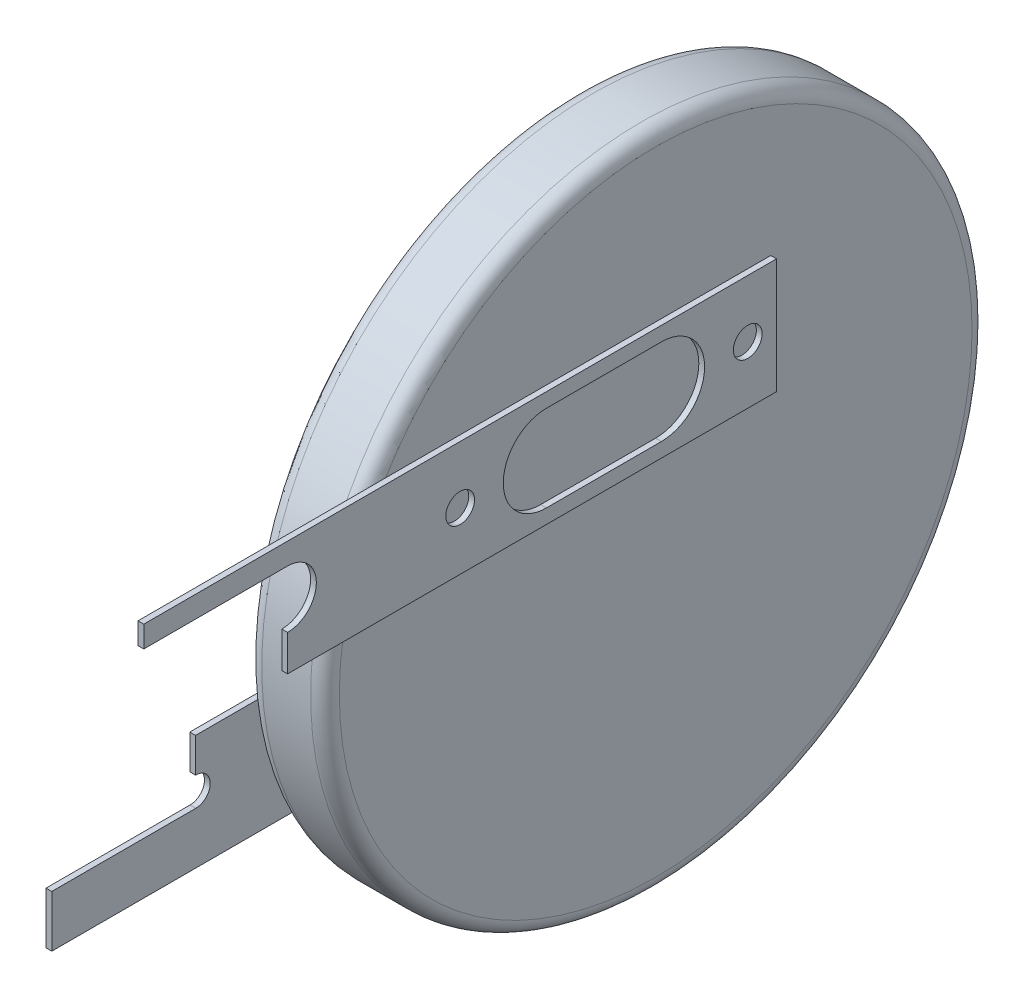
ISO-10303-21;
HEADER;
FILE_DESCRIPTION(('STEP AP214'),'2;1');
FILE_NAME('part.step','',(''),(''),'','','');
FILE_SCHEMA(('AUTOMOTIVE_DESIGN { 1 0 10303 214 1 1 1 1 }'));
ENDSEC;
DATA;
#1=APPLICATION_CONTEXT('core data for automotive mechanical design processes');
#2=APPLICATION_PROTOCOL_DEFINITION('international standard','automotive_design',2000,#1);
#3=PRODUCT_CONTEXT('',#1,'mechanical');
#4=PRODUCT('Part','Part','',(#3));
#5=PRODUCT_RELATED_PRODUCT_CATEGORY('part','',(#4));
#6=PRODUCT_DEFINITION_FORMATION('','',#4);
#7=PRODUCT_DEFINITION_CONTEXT('part definition',#1,'design');
#8=PRODUCT_DEFINITION('design','',#6,#7);
#9=PRODUCT_DEFINITION_SHAPE('','',#8);
#10=(LENGTH_UNIT() NAMED_UNIT(*) SI_UNIT(.MILLI.,.METRE.));
#11=(NAMED_UNIT(*) PLANE_ANGLE_UNIT() SI_UNIT($,.RADIAN.));
#12=(NAMED_UNIT(*) SI_UNIT($,.STERADIAN.) SOLID_ANGLE_UNIT());
#13=UNCERTAINTY_MEASURE_WITH_UNIT(LENGTH_MEASURE(1.E-05),#10,'distance_accuracy_value','');
#14=(GEOMETRIC_REPRESENTATION_CONTEXT(3) GLOBAL_UNCERTAINTY_ASSIGNED_CONTEXT((#13)) GLOBAL_UNIT_ASSIGNED_CONTEXT((#10,
#11,#12)) REPRESENTATION_CONTEXT('',''));
#15=CARTESIAN_POINT('',(0.,0.,0.));
#16=DIRECTION('',(0.,0.,1.));
#17=DIRECTION('',(1.,0.,0.));
#18=AXIS2_PLACEMENT_3D('',#15,#16,#17);
#19=CARTESIAN_POINT('',(0.,0.,0.));
#20=DIRECTION('',(1.,0.,0.));
#21=DIRECTION('',(0.,0.,-1.));
#22=AXIS2_PLACEMENT_3D('',#19,#20,#21);
#23=PLANE('',#22);
#24=DIRECTION('',(0.,1.,0.));
#25=VECTOR('',#24,1.);
#26=CARTESIAN_POINT('',(0.,5.725,-4.));
#27=LINE('',#26,#25);
#28=CARTESIAN_POINT('',(0.,1.725,-4.));
#29=VERTEX_POINT('',#28);
#30=CARTESIAN_POINT('',(0.,5.725,-4.));
#31=VERTEX_POINT('',#30);
#32=EDGE_CURVE('E70',#29,#31,#27,.T.);
#33=ORIENTED_EDGE('',*,*,#32,.F.);
#34=DIRECTION('',(0.,0.,-1.));
#35=VECTOR('',#34,1.);
#36=CARTESIAN_POINT('',(0.,1.725,13.));
#37=LINE('',#36,#35);
#38=CARTESIAN_POINT('',(0.,1.725,10.8639023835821));
#39=VERTEX_POINT('',#38);
#40=EDGE_CURVE('E294',#39,#29,#37,.T.);
#41=ORIENTED_EDGE('',*,*,#40,.F.);
#42=CARTESIAN_POINT('',(0.,0.,0.));
#43=DIRECTION('',(1.,0.,0.));
#44=DIRECTION('',(0.,0.,-1.));
#45=AXIS2_PLACEMENT_3D('',#42,#43,#44);
#46=CIRCLE('',#45,11.);
#47=CARTESIAN_POINT('',(0.,5.725,9.39278313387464));
#48=VERTEX_POINT('',#47);
#49=EDGE_CURVE('E434',#39,#48,#46,.T.);
#50=ORIENTED_EDGE('',*,*,#49,.T.);
#51=DIRECTION('',(0.,0.,1.));
#52=VECTOR('',#51,1.);
#53=CARTESIAN_POINT('',(0.,5.725,18.));
#54=LINE('',#53,#52);
#55=EDGE_CURVE('E75',#31,#48,#54,.T.);
#56=ORIENTED_EDGE('',*,*,#55,.F.);
#57=EDGE_LOOP('',(#33,#41,#50,#56));
#58=FACE_BOUND('',#57,.T.);
#59=ADVANCED_FACE('F55',(#58),#23,.T.);
#60=CARTESIAN_POINT('',(-0.500000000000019,0.,0.));
#61=DIRECTION('',(1.,0.,0.));
#62=DIRECTION('',(0.,0.,-1.));
#63=AXIS2_PLACEMENT_3D('',#60,#61,#62);
#64=TOROIDAL_SURFACE('',#63,11.,0.5);
#65=CARTESIAN_POINT('',(-0.500000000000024,0.,0.));
#66=DIRECTION('',(1.,0.,0.));
#67=DIRECTION('',(0.,0.,-1.));
#68=AXIS2_PLACEMENT_3D('',#65,#66,#67);
#69=CIRCLE('',#68,11.5);
#70=CARTESIAN_POINT('',(-0.500000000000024,0.,-11.5));
#71=VERTEX_POINT('',#70);
#72=EDGE_CURVE('E431',#71,#71,#69,.T.);
#73=ORIENTED_EDGE('',*,*,#72,.T.);
#74=EDGE_LOOP('',(#73));
#75=FACE_BOUND('',#74,.T.);
#76=EDGE_CURVE('E435',#48,#39,#46,.T.);
#77=ORIENTED_EDGE('',*,*,#76,.F.);
#78=ORIENTED_EDGE('',*,*,#49,.F.);
#79=EDGE_LOOP('',(#77,#78));
#80=FACE_BOUND('',#79,.T.);
#81=ADVANCED_FACE('F462',(#75,#80),#64,.T.);
#82=CARTESIAN_POINT('',(0.,0.,0.));
#83=DIRECTION('',(1.,0.,0.));
#84=DIRECTION('',(0.,0.,-1.));
#85=AXIS2_PLACEMENT_3D('',#82,#83,#84);
#86=CYLINDRICAL_SURFACE('',#85,11.5);
#87=CARTESIAN_POINT('',(-2.20000000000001,0.,0.));
#88=DIRECTION('',(1.,0.,0.));
#89=DIRECTION('',(0.,0.,-1.));
#90=AXIS2_PLACEMENT_3D('',#87,#88,#89);
#91=CIRCLE('',#90,11.5);
#92=CARTESIAN_POINT('',(-2.20000000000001,0.,-11.5));
#93=VERTEX_POINT('',#92);
#94=EDGE_CURVE('E428',#93,#93,#91,.T.);
#95=ORIENTED_EDGE('',*,*,#94,.T.);
#96=EDGE_LOOP('',(#95));
#97=FACE_BOUND('',#96,.T.);
#98=ORIENTED_EDGE('',*,*,#72,.F.);
#99=EDGE_LOOP('',(#98));
#100=FACE_BOUND('',#99,.T.);
#101=ADVANCED_FACE('F467',(#97,#100),#86,.T.);
#102=CARTESIAN_POINT('',(-2.20000000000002,0.,0.));
#103=DIRECTION('',(1.,0.,0.));
#104=DIRECTION('',(0.,0.,-1.));
#105=AXIS2_PLACEMENT_3D('',#102,#103,#104);
#106=TOROIDAL_SURFACE('',#105,11.,0.499999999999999);
#107=CARTESIAN_POINT('',(-2.70000000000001,0.,0.));
#108=DIRECTION('',(1.,0.,0.));
#109=DIRECTION('',(0.,0.,-1.));
#110=AXIS2_PLACEMENT_3D('',#107,#108,#109);
#111=CIRCLE('',#110,11.);
#112=CARTESIAN_POINT('',(-2.70000000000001,0.,-11.));
#113=VERTEX_POINT('',#112);
#114=EDGE_CURVE('E425',#113,#113,#111,.T.);
#115=ORIENTED_EDGE('',*,*,#114,.T.);
#116=EDGE_LOOP('',(#115));
#117=FACE_BOUND('',#116,.T.);
#118=ORIENTED_EDGE('',*,*,#94,.F.);
#119=EDGE_LOOP('',(#118));
#120=FACE_BOUND('',#119,.T.);
#121=ADVANCED_FACE('F473',(#117,#120),#106,.T.);
#122=CARTESIAN_POINT('',(-2.70000000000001,11.,0.));
#123=DIRECTION('',(-1.,0.,0.));
#124=DIRECTION('',(0.,0.,1.));
#125=AXIS2_PLACEMENT_3D('',#122,#123,#124);
#126=PLANE('',#125);
#127=CARTESIAN_POINT('',(-2.7,0.,0.));
#128=DIRECTION('',(1.,0.,0.));
#129=DIRECTION('',(0.,0.,-1.));
#130=AXIS2_PLACEMENT_3D('',#127,#128,#129);
#131=CIRCLE('',#130,9.5);
#132=CARTESIAN_POINT('',(-2.7,0.,-9.5));
#133=VERTEX_POINT('',#132);
#134=EDGE_CURVE('E422',#133,#133,#131,.T.);
#135=ORIENTED_EDGE('',*,*,#134,.T.);
#136=EDGE_LOOP('',(#135));
#137=FACE_BOUND('',#136,.T.);
#138=ORIENTED_EDGE('',*,*,#114,.F.);
#139=EDGE_LOOP('',(#138));
#140=FACE_BOUND('',#139,.T.);
#141=ADVANCED_FACE('F480',(#137,#140),#126,.T.);
#142=CARTESIAN_POINT('',(0.,0.,0.));
#143=DIRECTION('',(1.,0.,0.));
#144=DIRECTION('',(0.,0.,-1.));
#145=AXIS2_PLACEMENT_3D('',#142,#143,#144);
#146=CYLINDRICAL_SURFACE('',#145,9.5);
#147=CARTESIAN_POINT('',(-2.75,0.,0.));
#148=DIRECTION('',(1.,0.,0.));
#149=DIRECTION('',(0.,0.,-1.));
#150=AXIS2_PLACEMENT_3D('',#147,#148,#149);
#151=CIRCLE('',#150,9.5);
#152=CARTESIAN_POINT('',(-2.75,0.,-9.5));
#153=VERTEX_POINT('',#152);
#154=EDGE_CURVE('E419',#153,#153,#151,.T.);
#155=ORIENTED_EDGE('',*,*,#154,.T.);
#156=EDGE_LOOP('',(#155));
#157=FACE_BOUND('',#156,.T.);
#158=ORIENTED_EDGE('',*,*,#134,.F.);
#159=EDGE_LOOP('',(#158));
#160=FACE_BOUND('',#159,.T.);
#161=ADVANCED_FACE('F484',(#157,#160),#146,.T.);
#162=CARTESIAN_POINT('',(-2.75,0.,0.));
#163=DIRECTION('',(1.,0.,0.));
#164=DIRECTION('',(0.,0.,-1.));
#165=AXIS2_PLACEMENT_3D('',#162,#163,#164);
#166=TOROIDAL_SURFACE('',#165,9.25,0.25);
#167=CARTESIAN_POINT('',(-3.,0.,0.));
#168=DIRECTION('',(1.,0.,0.));
#169=DIRECTION('',(0.,0.,-1.));
#170=AXIS2_PLACEMENT_3D('',#167,#168,#169);
#171=CIRCLE('',#170,9.25);
#172=CARTESIAN_POINT('',(-3.,-1.72500000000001,9.08773211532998));
#173=VERTEX_POINT('',#172);
#174=CARTESIAN_POINT('',(-3.,-5.725,7.26545765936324));
#175=VERTEX_POINT('',#174);
#176=EDGE_CURVE('E416',#173,#175,#171,.T.);
#177=ORIENTED_EDGE('',*,*,#176,.T.);
#178=EDGE_CURVE('E415',#175,#173,#171,.T.);
#179=ORIENTED_EDGE('',*,*,#178,.T.);
#180=EDGE_LOOP('',(#177,#179));
#181=FACE_BOUND('',#180,.T.);
#182=ORIENTED_EDGE('',*,*,#154,.F.);
#183=EDGE_LOOP('',(#182));
#184=FACE_BOUND('',#183,.T.);
#185=ADVANCED_FACE('F488',(#181,#184),#166,.T.);
#186=CARTESIAN_POINT('',(-3.,9.25,0.));
#187=DIRECTION('',(-1.,0.,0.));
#188=DIRECTION('',(0.,0.,1.));
#189=AXIS2_PLACEMENT_3D('',#186,#187,#188);
#190=PLANE('',#189);
#191=ORIENTED_EDGE('',*,*,#178,.F.);
#192=DIRECTION('',(0.,0.,1.));
#193=VECTOR('',#192,1.);
#194=CARTESIAN_POINT('',(-3.,-5.725,-4.));
#195=LINE('',#194,#193);
#196=CARTESIAN_POINT('',(-3.,-5.725,-4.));
#197=VERTEX_POINT('',#196);
#198=EDGE_CURVE('E379',#197,#175,#195,.T.);
#199=ORIENTED_EDGE('',*,*,#198,.F.);
#200=DIRECTION('',(0.,-1.,0.));
#201=VECTOR('',#200,1.);
#202=CARTESIAN_POINT('',(-3.,-1.725,-4.));
#203=LINE('',#202,#201);
#204=CARTESIAN_POINT('',(-3.,-1.725,-4.));
#205=VERTEX_POINT('',#204);
#206=EDGE_CURVE('E356',#205,#197,#203,.T.);
#207=ORIENTED_EDGE('',*,*,#206,.F.);
#208=DIRECTION('',(0.,0.,1.));
#209=VECTOR('',#208,1.);
#210=CARTESIAN_POINT('',(-3.,-1.72500000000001,0.));
#211=LINE('',#210,#209);
#212=EDGE_CURVE('E444',#205,#173,#211,.T.);
#213=ORIENTED_EDGE('',*,*,#212,.T.);
#214=EDGE_LOOP('',(#191,#199,#207,#213));
#215=FACE_BOUND('',#214,.T.);
#216=ADVANCED_FACE('F492',(#215),#190,.T.);
#217=CARTESIAN_POINT('',(-3.2,-3.425,12.99));
#218=DIRECTION('',(-1.,0.,0.));
#219=DIRECTION('',(0.,0.,1.));
#220=AXIS2_PLACEMENT_3D('',#217,#218,#219);
#221=PLANE('',#220);
#222=CARTESIAN_POINT('',(-3.2,-3.725,-3.));
#223=DIRECTION('',(-1.,0.,0.));
#224=DIRECTION('',(0.,0.,1.));
#225=AXIS2_PLACEMENT_3D('',#222,#223,#224);
#226=CIRCLE('',#225,0.5);
#227=CARTESIAN_POINT('',(-3.2,-3.725,-2.5));
#228=VERTEX_POINT('',#227);
#229=EDGE_CURVE('E324',#228,#228,#226,.T.);
#230=ORIENTED_EDGE('',*,*,#229,.F.);
#231=EDGE_LOOP('',(#230));
#232=FACE_BOUND('',#231,.T.);
#233=DIRECTION('',(0.,-1.,0.));
#234=VECTOR('',#233,1.);
#235=CARTESIAN_POINT('',(-3.2,-1.725,-4.));
#236=LINE('',#235,#234);
#237=CARTESIAN_POINT('',(-3.2,-1.725,-4.));
#238=VERTEX_POINT('',#237);
#239=CARTESIAN_POINT('',(-3.2,-5.725,-4.));
#240=VERTEX_POINT('',#239);
#241=EDGE_CURVE('E357',#238,#240,#236,.T.);
#242=ORIENTED_EDGE('',*,*,#241,.T.);
#243=DIRECTION('',(0.,0.,1.));
#244=VECTOR('',#243,1.);
#245=CARTESIAN_POINT('',(-3.2,-5.725,-4.));
#246=LINE('',#245,#244);
#247=CARTESIAN_POINT('',(-3.2,-5.725,18.));
#248=VERTEX_POINT('',#247);
#249=EDGE_CURVE('E360',#240,#248,#246,.T.);
#250=ORIENTED_EDGE('',*,*,#249,.T.);
#251=DIRECTION('',(0.,1.,0.));
#252=VECTOR('',#251,1.);
#253=CARTESIAN_POINT('',(-3.2,-3.925,18.));
#254=LINE('',#253,#252);
#255=CARTESIAN_POINT('',(-3.2,-3.925,18.));
#256=VERTEX_POINT('',#255);
#257=EDGE_CURVE('E363',#248,#256,#254,.T.);
#258=ORIENTED_EDGE('',*,*,#257,.T.);
#259=DIRECTION('',(0.,0.,-1.));
#260=VECTOR('',#259,1.);
#261=CARTESIAN_POINT('',(-3.2,-3.925,18.));
#262=LINE('',#261,#260);
#263=CARTESIAN_POINT('',(-3.2,-3.925,12.99));
#264=VERTEX_POINT('',#263);
#265=EDGE_CURVE('E365',#256,#264,#262,.T.);
#266=ORIENTED_EDGE('',*,*,#265,.T.);
#267=CARTESIAN_POINT('',(-3.2,-3.425,12.99));
#268=DIRECTION('',(1.,0.,0.));
#269=DIRECTION('',(0.,0.,1.));
#270=AXIS2_PLACEMENT_3D('',#267,#268,#269);
#271=CIRCLE('',#270,0.5);
#272=CARTESIAN_POINT('',(-3.2,-2.925,12.99));
#273=VERTEX_POINT('',#272);
#274=EDGE_CURVE('E367',#264,#273,#271,.T.);
#275=ORIENTED_EDGE('',*,*,#274,.T.);
#276=DIRECTION('',(0.,0.,1.));
#277=VECTOR('',#276,1.);
#278=CARTESIAN_POINT('',(-3.2,-2.925,12.99));
#279=LINE('',#278,#277);
#280=CARTESIAN_POINT('',(-3.2,-2.925,13.));
#281=VERTEX_POINT('',#280);
#282=EDGE_CURVE('E369',#273,#281,#279,.T.);
#283=ORIENTED_EDGE('',*,*,#282,.T.);
#284=DIRECTION('',(0.,1.,0.));
#285=VECTOR('',#284,1.);
#286=CARTESIAN_POINT('',(-3.2,-2.925,13.));
#287=LINE('',#286,#285);
#288=CARTESIAN_POINT('',(-3.2,-1.72500000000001,13.));
#289=VERTEX_POINT('',#288);
#290=EDGE_CURVE('E371',#281,#289,#287,.T.);
#291=ORIENTED_EDGE('',*,*,#290,.T.);
#292=DIRECTION('',(0.,0.,-1.));
#293=VECTOR('',#292,1.);
#294=CARTESIAN_POINT('',(-3.2,-1.725,-4.));
#295=LINE('',#294,#293);
#296=EDGE_CURVE('E373',#289,#238,#295,.T.);
#297=ORIENTED_EDGE('',*,*,#296,.T.);
#298=EDGE_LOOP('',(#242,#250,#258,#266,#275,#283,#291,#297));
#299=FACE_BOUND('',#298,.T.);
#300=DIRECTION('',(0.,0.,1.));
#301=VECTOR('',#300,1.);
#302=CARTESIAN_POINT('',(-3.2,-5.22500000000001,0.));
#303=LINE('',#302,#301);
#304=CARTESIAN_POINT('',(-3.2,-5.22500000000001,0.));
#305=VERTEX_POINT('',#304);
#306=CARTESIAN_POINT('',(-3.2,-5.225,4.));
#307=VERTEX_POINT('',#306);
#308=EDGE_CURVE('E330',#305,#307,#303,.T.);
#309=ORIENTED_EDGE('',*,*,#308,.F.);
#310=CARTESIAN_POINT('',(-3.2,-3.72500000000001,0.));
#311=DIRECTION('',(-1.,0.,0.));
#312=DIRECTION('',(0.,0.,1.));
#313=AXIS2_PLACEMENT_3D('',#310,#311,#312);
#314=CIRCLE('',#313,1.5);
#315=CARTESIAN_POINT('',(-3.2,-2.22500000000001,0.));
#316=VERTEX_POINT('',#315);
#317=EDGE_CURVE('E328',#316,#305,#314,.T.);
#318=ORIENTED_EDGE('',*,*,#317,.F.);
#319=DIRECTION('',(0.,0.,-1.));
#320=VECTOR('',#319,1.);
#321=CARTESIAN_POINT('',(-3.2,-2.22500000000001,0.));
#322=LINE('',#321,#320);
#323=CARTESIAN_POINT('',(-3.2,-2.225,4.));
#324=VERTEX_POINT('',#323);
#325=EDGE_CURVE('E336',#324,#316,#322,.T.);
#326=ORIENTED_EDGE('',*,*,#325,.F.);
#327=CARTESIAN_POINT('',(-3.2,-3.725,4.));
#328=DIRECTION('',(-1.,0.,0.));
#329=DIRECTION('',(0.,0.,1.));
#330=AXIS2_PLACEMENT_3D('',#327,#328,#329);
#331=CIRCLE('',#330,1.5);
#332=EDGE_CURVE('E333',#307,#324,#331,.T.);
#333=ORIENTED_EDGE('',*,*,#332,.F.);
#334=EDGE_LOOP('',(#309,#318,#326,#333));
#335=FACE_BOUND('',#334,.T.);
#336=CARTESIAN_POINT('',(-3.2,-3.725,7.));
#337=DIRECTION('',(-1.,0.,0.));
#338=DIRECTION('',(0.,0.,1.));
#339=AXIS2_PLACEMENT_3D('',#336,#337,#338);
#340=CIRCLE('',#339,0.500000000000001);
#341=CARTESIAN_POINT('',(-3.2,-3.725,7.5));
#342=VERTEX_POINT('',#341);
#343=EDGE_CURVE('E321',#342,#342,#340,.T.);
#344=ORIENTED_EDGE('',*,*,#343,.F.);
#345=EDGE_LOOP('',(#344));
#346=FACE_BOUND('',#345,.T.);
#347=ADVANCED_FACE('F496',(#232,#299,#335,#346),#221,.T.);
#348=CARTESIAN_POINT('',(-3.,-3.425,12.99));
#349=DIRECTION('',(-1.,0.,0.));
#350=DIRECTION('',(0.,0.,1.));
#351=AXIS2_PLACEMENT_3D('',#348,#349,#350);
#352=PLANE('',#351);
#353=CARTESIAN_POINT('',(-3.,-5.725,18.));
#354=VERTEX_POINT('',#353);
#355=EDGE_CURVE('E378',#175,#354,#195,.T.);
#356=ORIENTED_EDGE('',*,*,#355,.F.);
#357=ORIENTED_EDGE('',*,*,#176,.F.);
#358=DIRECTION('',(0.,0.,-1.));
#359=VECTOR('',#358,1.);
#360=CARTESIAN_POINT('',(-3.,-1.725,-4.));
#361=LINE('',#360,#359);
#362=CARTESIAN_POINT('',(-3.,-1.72500000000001,13.));
#363=VERTEX_POINT('',#362);
#364=EDGE_CURVE('E361',#363,#173,#361,.T.);
#365=ORIENTED_EDGE('',*,*,#364,.F.);
#366=DIRECTION('',(0.,1.,0.));
#367=VECTOR('',#366,1.);
#368=CARTESIAN_POINT('',(-3.,-2.925,13.));
#369=LINE('',#368,#367);
#370=CARTESIAN_POINT('',(-3.,-2.925,13.));
#371=VERTEX_POINT('',#370);
#372=EDGE_CURVE('E390',#371,#363,#369,.T.);
#373=ORIENTED_EDGE('',*,*,#372,.F.);
#374=DIRECTION('',(0.,0.,1.));
#375=VECTOR('',#374,1.);
#376=CARTESIAN_POINT('',(-3.,-2.925,12.99));
#377=LINE('',#376,#375);
#378=CARTESIAN_POINT('',(-3.,-2.925,12.99));
#379=VERTEX_POINT('',#378);
#380=EDGE_CURVE('E388',#379,#371,#377,.T.);
#381=ORIENTED_EDGE('',*,*,#380,.F.);
#382=CARTESIAN_POINT('',(-3.,-3.425,12.99));
#383=DIRECTION('',(1.,0.,0.));
#384=DIRECTION('',(0.,0.,1.));
#385=AXIS2_PLACEMENT_3D('',#382,#383,#384);
#386=CIRCLE('',#385,0.5);
#387=CARTESIAN_POINT('',(-3.,-3.925,12.99));
#388=VERTEX_POINT('',#387);
#389=EDGE_CURVE('E386',#388,#379,#386,.T.);
#390=ORIENTED_EDGE('',*,*,#389,.F.);
#391=DIRECTION('',(0.,0.,-1.));
#392=VECTOR('',#391,1.);
#393=CARTESIAN_POINT('',(-3.,-3.925,18.));
#394=LINE('',#393,#392);
#395=CARTESIAN_POINT('',(-3.,-3.925,18.));
#396=VERTEX_POINT('',#395);
#397=EDGE_CURVE('E384',#396,#388,#394,.T.);
#398=ORIENTED_EDGE('',*,*,#397,.F.);
#399=DIRECTION('',(0.,1.,0.));
#400=VECTOR('',#399,1.);
#401=CARTESIAN_POINT('',(-3.,-3.925,18.));
#402=LINE('',#401,#400);
#403=EDGE_CURVE('E382',#354,#396,#402,.T.);
#404=ORIENTED_EDGE('',*,*,#403,.F.);
#405=EDGE_LOOP('',(#356,#357,#365,#373,#381,#390,#398,#404));
#406=FACE_BOUND('',#405,.T.);
#407=ADVANCED_FACE('F504',(#406),#352,.F.);
#408=CARTESIAN_POINT('',(-3.2,-1.725,-4.));
#409=DIRECTION('',(0.,0.,1.));
#410=DIRECTION('',(1.,0.,0.));
#411=AXIS2_PLACEMENT_3D('',#408,#409,#410);
#412=PLANE('',#411);
#413=ORIENTED_EDGE('',*,*,#206,.T.);
#414=DIRECTION('',(1.,0.,0.));
#415=VECTOR('',#414,1.);
#416=CARTESIAN_POINT('',(-3.2,-5.725,-4.));
#417=LINE('',#416,#415);
#418=EDGE_CURVE('E413',#240,#197,#417,.T.);
#419=ORIENTED_EDGE('',*,*,#418,.F.);
#420=ORIENTED_EDGE('',*,*,#241,.F.);
#421=DIRECTION('',(1.,0.,0.));
#422=VECTOR('',#421,1.);
#423=CARTESIAN_POINT('',(-3.2,-1.725,-4.));
#424=LINE('',#423,#422);
#425=EDGE_CURVE('E375',#238,#205,#424,.T.);
#426=ORIENTED_EDGE('',*,*,#425,.T.);
#427=EDGE_LOOP('',(#413,#419,#420,#426));
#428=FACE_BOUND('',#427,.T.);
#429=ADVANCED_FACE('F500',(#428),#412,.F.);
#430=CARTESIAN_POINT('',(-3.2,-5.725,-4.));
#431=DIRECTION('',(0.,1.,0.));
#432=DIRECTION('',(0.,0.,1.));
#433=AXIS2_PLACEMENT_3D('',#430,#431,#432);
#434=PLANE('',#433);
#435=ORIENTED_EDGE('',*,*,#198,.T.);
#436=ORIENTED_EDGE('',*,*,#355,.T.);
#437=DIRECTION('',(1.,0.,0.));
#438=VECTOR('',#437,1.);
#439=CARTESIAN_POINT('',(-3.2,-5.725,18.));
#440=LINE('',#439,#438);
#441=EDGE_CURVE('E410',#248,#354,#440,.T.);
#442=ORIENTED_EDGE('',*,*,#441,.F.);
#443=ORIENTED_EDGE('',*,*,#249,.F.);
#444=ORIENTED_EDGE('',*,*,#418,.T.);
#445=EDGE_LOOP('',(#435,#436,#442,#443,#444));
#446=FACE_BOUND('',#445,.T.);
#447=ADVANCED_FACE('F503',(#446),#434,.F.);
#448=CARTESIAN_POINT('',(-3.2,-3.925,18.));
#449=DIRECTION('',(0.,0.,-1.));
#450=DIRECTION('',(-1.,0.,0.));
#451=AXIS2_PLACEMENT_3D('',#448,#449,#450);
#452=PLANE('',#451);
#453=ORIENTED_EDGE('',*,*,#403,.T.);
#454=DIRECTION('',(1.,0.,0.));
#455=VECTOR('',#454,1.);
#456=CARTESIAN_POINT('',(-3.2,-3.925,18.));
#457=LINE('',#456,#455);
#458=EDGE_CURVE('E407',#256,#396,#457,.T.);
#459=ORIENTED_EDGE('',*,*,#458,.F.);
#460=ORIENTED_EDGE('',*,*,#257,.F.);
#461=ORIENTED_EDGE('',*,*,#441,.T.);
#462=EDGE_LOOP('',(#453,#459,#460,#461));
#463=FACE_BOUND('',#462,.T.);
#464=ADVANCED_FACE('F508',(#463),#452,.F.);
#465=CARTESIAN_POINT('',(-3.2,-3.925,18.));
#466=DIRECTION('',(0.,-1.,0.));
#467=DIRECTION('',(0.,0.,-1.));
#468=AXIS2_PLACEMENT_3D('',#465,#466,#467);
#469=PLANE('',#468);
#470=ORIENTED_EDGE('',*,*,#397,.T.);
#471=DIRECTION('',(1.,0.,0.));
#472=VECTOR('',#471,1.);
#473=CARTESIAN_POINT('',(-3.2,-3.925,12.99));
#474=LINE('',#473,#472);
#475=EDGE_CURVE('E404',#264,#388,#474,.T.);
#476=ORIENTED_EDGE('',*,*,#475,.F.);
#477=ORIENTED_EDGE('',*,*,#265,.F.);
#478=ORIENTED_EDGE('',*,*,#458,.T.);
#479=EDGE_LOOP('',(#470,#476,#477,#478));
#480=FACE_BOUND('',#479,.T.);
#481=ADVANCED_FACE('F512',(#480),#469,.F.);
#482=CARTESIAN_POINT('',(-3.2,-3.425,12.99));
#483=DIRECTION('',(1.,0.,0.));
#484=DIRECTION('',(0.,0.,-1.));
#485=AXIS2_PLACEMENT_3D('',#482,#483,#484);
#486=CYLINDRICAL_SURFACE('',#485,0.5);
#487=ORIENTED_EDGE('',*,*,#389,.T.);
#488=DIRECTION('',(1.,0.,0.));
#489=VECTOR('',#488,1.);
#490=CARTESIAN_POINT('',(-3.2,-2.925,12.99));
#491=LINE('',#490,#489);
#492=EDGE_CURVE('E401',#273,#379,#491,.T.);
#493=ORIENTED_EDGE('',*,*,#492,.F.);
#494=ORIENTED_EDGE('',*,*,#274,.F.);
#495=ORIENTED_EDGE('',*,*,#475,.T.);
#496=EDGE_LOOP('',(#487,#493,#494,#495));
#497=FACE_BOUND('',#496,.T.);
#498=ADVANCED_FACE('F516',(#497),#486,.F.);
#499=CARTESIAN_POINT('',(-3.2,-2.925,12.99));
#500=DIRECTION('',(0.,1.,0.));
#501=DIRECTION('',(0.,0.,1.));
#502=AXIS2_PLACEMENT_3D('',#499,#500,#501);
#503=PLANE('',#502);
#504=ORIENTED_EDGE('',*,*,#380,.T.);
#505=DIRECTION('',(1.,0.,0.));
#506=VECTOR('',#505,1.);
#507=CARTESIAN_POINT('',(-3.2,-2.925,13.));
#508=LINE('',#507,#506);
#509=EDGE_CURVE('E398',#281,#371,#508,.T.);
#510=ORIENTED_EDGE('',*,*,#509,.F.);
#511=ORIENTED_EDGE('',*,*,#282,.F.);
#512=ORIENTED_EDGE('',*,*,#492,.T.);
#513=EDGE_LOOP('',(#504,#510,#511,#512));
#514=FACE_BOUND('',#513,.T.);
#515=ADVANCED_FACE('F520',(#514),#503,.F.);
#516=CARTESIAN_POINT('',(-3.2,-2.925,13.));
#517=DIRECTION('',(0.,0.,-1.));
#518=DIRECTION('',(-1.,0.,0.));
#519=AXIS2_PLACEMENT_3D('',#516,#517,#518);
#520=PLANE('',#519);
#521=ORIENTED_EDGE('',*,*,#372,.T.);
#522=DIRECTION('',(1.,0.,0.));
#523=VECTOR('',#522,1.);
#524=CARTESIAN_POINT('',(-3.2,-1.72500000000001,13.));
#525=LINE('',#524,#523);
#526=EDGE_CURVE('E395',#289,#363,#525,.T.);
#527=ORIENTED_EDGE('',*,*,#526,.F.);
#528=ORIENTED_EDGE('',*,*,#290,.F.);
#529=ORIENTED_EDGE('',*,*,#509,.T.);
#530=EDGE_LOOP('',(#521,#527,#528,#529));
#531=FACE_BOUND('',#530,.T.);
#532=ADVANCED_FACE('F524',(#531),#520,.F.);
#533=CARTESIAN_POINT('',(-3.2,-1.725,-4.));
#534=DIRECTION('',(0.,-1.,0.));
#535=DIRECTION('',(0.,0.,-1.));
#536=AXIS2_PLACEMENT_3D('',#533,#534,#535);
#537=PLANE('',#536);
#538=ORIENTED_EDGE('',*,*,#364,.T.);
#539=ORIENTED_EDGE('',*,*,#212,.F.);
#540=ORIENTED_EDGE('',*,*,#425,.F.);
#541=ORIENTED_EDGE('',*,*,#296,.F.);
#542=ORIENTED_EDGE('',*,*,#526,.T.);
#543=EDGE_LOOP('',(#538,#539,#540,#541,#542));
#544=FACE_BOUND('',#543,.T.);
#545=ADVANCED_FACE('F528',(#544),#537,.F.);
#546=CARTESIAN_POINT('',(-3.2,-3.72500000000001,0.));
#547=DIRECTION('',(1.,0.,0.));
#548=DIRECTION('',(0.,0.,-1.));
#549=AXIS2_PLACEMENT_3D('',#546,#547,#548);
#550=CYLINDRICAL_SURFACE('',#549,1.5);
#551=CARTESIAN_POINT('',(-3.,-3.72500000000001,0.));
#552=DIRECTION('',(-1.,0.,0.));
#553=DIRECTION('',(0.,0.,1.));
#554=AXIS2_PLACEMENT_3D('',#551,#552,#553);
#555=CIRCLE('',#554,1.5);
#556=CARTESIAN_POINT('',(-3.,-2.22500000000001,0.));
#557=VERTEX_POINT('',#556);
#558=CARTESIAN_POINT('',(-3.,-5.22500000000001,0.));
#559=VERTEX_POINT('',#558);
#560=EDGE_CURVE('E327',#557,#559,#555,.T.);
#561=ORIENTED_EDGE('',*,*,#560,.F.);
#562=DIRECTION('',(1.,0.,0.));
#563=VECTOR('',#562,1.);
#564=CARTESIAN_POINT('',(-3.2,-2.22500000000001,0.));
#565=LINE('',#564,#563);
#566=EDGE_CURVE('E338',#316,#557,#565,.T.);
#567=ORIENTED_EDGE('',*,*,#566,.F.);
#568=ORIENTED_EDGE('',*,*,#317,.T.);
#569=DIRECTION('',(1.,0.,0.));
#570=VECTOR('',#569,1.);
#571=CARTESIAN_POINT('',(-3.2,-5.22500000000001,0.));
#572=LINE('',#571,#570);
#573=EDGE_CURVE('E353',#305,#559,#572,.T.);
#574=ORIENTED_EDGE('',*,*,#573,.T.);
#575=EDGE_LOOP('',(#561,#567,#568,#574));
#576=FACE_BOUND('',#575,.T.);
#577=ADVANCED_FACE('F532',(#576),#550,.F.);
#578=CARTESIAN_POINT('',(-3.2,-5.22500000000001,0.));
#579=DIRECTION('',(0.,1.,0.));
#580=DIRECTION('',(0.,0.,1.));
#581=AXIS2_PLACEMENT_3D('',#578,#579,#580);
#582=PLANE('',#581);
#583=DIRECTION('',(0.,0.,1.));
#584=VECTOR('',#583,1.);
#585=CARTESIAN_POINT('',(-3.,-5.22500000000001,0.));
#586=LINE('',#585,#584);
#587=CARTESIAN_POINT('',(-3.,-5.225,4.));
#588=VERTEX_POINT('',#587);
#589=EDGE_CURVE('E340',#559,#588,#586,.T.);
#590=ORIENTED_EDGE('',*,*,#589,.F.);
#591=ORIENTED_EDGE('',*,*,#573,.F.);
#592=ORIENTED_EDGE('',*,*,#308,.T.);
#593=DIRECTION('',(1.,0.,0.));
#594=VECTOR('',#593,1.);
#595=CARTESIAN_POINT('',(-3.2,-5.225,4.));
#596=LINE('',#595,#594);
#597=EDGE_CURVE('E350',#307,#588,#596,.T.);
#598=ORIENTED_EDGE('',*,*,#597,.T.);
#599=EDGE_LOOP('',(#590,#591,#592,#598));
#600=FACE_BOUND('',#599,.T.);
#601=ADVANCED_FACE('F542',(#600),#582,.T.);
#602=CARTESIAN_POINT('',(-3.2,-3.725,4.));
#603=DIRECTION('',(1.,0.,0.));
#604=DIRECTION('',(0.,0.,-1.));
#605=AXIS2_PLACEMENT_3D('',#602,#603,#604);
#606=CYLINDRICAL_SURFACE('',#605,1.5);
#607=CARTESIAN_POINT('',(-3.,-3.725,4.));
#608=DIRECTION('',(-1.,0.,0.));
#609=DIRECTION('',(0.,0.,1.));
#610=AXIS2_PLACEMENT_3D('',#607,#608,#609);
#611=CIRCLE('',#610,1.5);
#612=CARTESIAN_POINT('',(-3.,-2.225,4.));
#613=VERTEX_POINT('',#612);
#614=EDGE_CURVE('E342',#588,#613,#611,.T.);
#615=ORIENTED_EDGE('',*,*,#614,.F.);
#616=ORIENTED_EDGE('',*,*,#597,.F.);
#617=ORIENTED_EDGE('',*,*,#332,.T.);
#618=DIRECTION('',(1.,0.,0.));
#619=VECTOR('',#618,1.);
#620=CARTESIAN_POINT('',(-3.2,-2.225,4.));
#621=LINE('',#620,#619);
#622=EDGE_CURVE('E347',#324,#613,#621,.T.);
#623=ORIENTED_EDGE('',*,*,#622,.T.);
#624=EDGE_LOOP('',(#615,#616,#617,#623));
#625=FACE_BOUND('',#624,.T.);
#626=ADVANCED_FACE('F546',(#625),#606,.F.);
#627=CARTESIAN_POINT('',(-3.2,-2.22500000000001,0.));
#628=DIRECTION('',(0.,-1.,0.));
#629=DIRECTION('',(0.,0.,-1.));
#630=AXIS2_PLACEMENT_3D('',#627,#628,#629);
#631=PLANE('',#630);
#632=DIRECTION('',(0.,0.,-1.));
#633=VECTOR('',#632,1.);
#634=CARTESIAN_POINT('',(-3.,-2.22500000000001,0.));
#635=LINE('',#634,#633);
#636=EDGE_CURVE('E331',#613,#557,#635,.T.);
#637=ORIENTED_EDGE('',*,*,#636,.F.);
#638=ORIENTED_EDGE('',*,*,#622,.F.);
#639=ORIENTED_EDGE('',*,*,#325,.T.);
#640=ORIENTED_EDGE('',*,*,#566,.T.);
#641=EDGE_LOOP('',(#637,#638,#639,#640));
#642=FACE_BOUND('',#641,.T.);
#643=ADVANCED_FACE('F550',(#642),#631,.T.);
#644=CARTESIAN_POINT('',(-3.2,-3.725,-3.));
#645=DIRECTION('',(1.,0.,0.));
#646=DIRECTION('',(0.,0.,-1.));
#647=AXIS2_PLACEMENT_3D('',#644,#645,#646);
#648=CYLINDRICAL_SURFACE('',#647,0.5);
#649=ORIENTED_EDGE('',*,*,#229,.T.);
#650=EDGE_LOOP('',(#649));
#651=FACE_BOUND('',#650,.T.);
#652=CARTESIAN_POINT('',(-3.,-3.725,-3.));
#653=DIRECTION('',(-1.,0.,0.));
#654=DIRECTION('',(0.,0.,1.));
#655=AXIS2_PLACEMENT_3D('',#652,#653,#654);
#656=CIRCLE('',#655,0.5);
#657=CARTESIAN_POINT('',(-3.,-3.725,-2.5));
#658=VERTEX_POINT('',#657);
#659=EDGE_CURVE('E441',#658,#658,#656,.F.);
#660=ORIENTED_EDGE('',*,*,#659,.T.);
#661=EDGE_LOOP('',(#660));
#662=FACE_BOUND('',#661,.T.);
#663=ADVANCED_FACE('F554',(#651,#662),#648,.F.);
#664=CARTESIAN_POINT('',(-3.2,-3.725,7.));
#665=DIRECTION('',(1.,0.,0.));
#666=DIRECTION('',(0.,0.,-1.));
#667=AXIS2_PLACEMENT_3D('',#664,#665,#666);
#668=CYLINDRICAL_SURFACE('',#667,0.500000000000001);
#669=ORIENTED_EDGE('',*,*,#343,.T.);
#670=EDGE_LOOP('',(#669));
#671=FACE_BOUND('',#670,.T.);
#672=CARTESIAN_POINT('',(-3.,-3.725,7.));
#673=DIRECTION('',(-1.,0.,0.));
#674=DIRECTION('',(0.,0.,1.));
#675=AXIS2_PLACEMENT_3D('',#672,#673,#674);
#676=CIRCLE('',#675,0.500000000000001);
#677=CARTESIAN_POINT('',(-3.,-3.725,7.5));
#678=VERTEX_POINT('',#677);
#679=EDGE_CURVE('E438',#678,#678,#676,.F.);
#680=ORIENTED_EDGE('',*,*,#679,.T.);
#681=EDGE_LOOP('',(#680));
#682=FACE_BOUND('',#681,.T.);
#683=ADVANCED_FACE('F558',(#671,#682),#668,.F.);
#684=ORIENTED_EDGE('',*,*,#679,.F.);
#685=EDGE_LOOP('',(#684));
#686=FACE_BOUND('',#685,.T.);
#687=ADVANCED_FACE('F499',(#686),#190,.T.);
#688=ORIENTED_EDGE('',*,*,#659,.F.);
#689=EDGE_LOOP('',(#688));
#690=FACE_BOUND('',#689,.T.);
#691=ADVANCED_FACE('F675',(#690),#190,.T.);
#692=ORIENTED_EDGE('',*,*,#560,.T.);
#693=ORIENTED_EDGE('',*,*,#589,.T.);
#694=ORIENTED_EDGE('',*,*,#614,.T.);
#695=ORIENTED_EDGE('',*,*,#636,.T.);
#696=EDGE_LOOP('',(#692,#693,#694,#695));
#697=FACE_BOUND('',#696,.T.);
#698=ADVANCED_FACE('F498',(#697),#190,.T.);
#699=CARTESIAN_POINT('',(0.2,3.975,13.));
#700=DIRECTION('',(1.,0.,0.));
#701=DIRECTION('',(0.,0.,-1.));
#702=AXIS2_PLACEMENT_3D('',#699,#700,#701);
#703=PLANE('',#702);
#704=CARTESIAN_POINT('',(0.2,3.725,-3.));
#705=DIRECTION('',(1.,0.,0.));
#706=DIRECTION('',(0.,0.,-1.));
#707=AXIS2_PLACEMENT_3D('',#704,#705,#706);
#708=CIRCLE('',#707,0.5);
#709=CARTESIAN_POINT('',(0.2,3.725,-3.5));
#710=VERTEX_POINT('',#709);
#711=EDGE_CURVE('E266',#710,#710,#708,.T.);
#712=ORIENTED_EDGE('',*,*,#711,.F.);
#713=EDGE_LOOP('',(#712));
#714=FACE_BOUND('',#713,.T.);
#715=DIRECTION('',(0.,-1.,0.));
#716=VECTOR('',#715,1.);
#717=CARTESIAN_POINT('',(0.2,5.725,18.));
#718=LINE('',#717,#716);
#719=CARTESIAN_POINT('',(0.2,5.725,18.));
#720=VERTEX_POINT('',#719);
#721=CARTESIAN_POINT('',(0.2,4.975,18.));
#722=VERTEX_POINT('',#721);
#723=EDGE_CURVE('E270',#720,#722,#718,.T.);
#724=ORIENTED_EDGE('',*,*,#723,.T.);
#725=DIRECTION('',(0.,0.,-1.));
#726=VECTOR('',#725,1.);
#727=CARTESIAN_POINT('',(0.2,4.975,13.));
#728=LINE('',#727,#726);
#729=CARTESIAN_POINT('',(0.2,4.975,13.));
#730=VERTEX_POINT('',#729);
#731=EDGE_CURVE('E273',#722,#730,#728,.T.);
#732=ORIENTED_EDGE('',*,*,#731,.T.);
#733=CARTESIAN_POINT('',(0.2,3.975,13.));
#734=DIRECTION('',(-1.,0.,0.));
#735=DIRECTION('',(0.,0.,-1.));
#736=AXIS2_PLACEMENT_3D('',#733,#734,#735);
#737=CIRCLE('',#736,1.);
#738=CARTESIAN_POINT('',(0.2,2.975,13.));
#739=VERTEX_POINT('',#738);
#740=EDGE_CURVE('E275',#730,#739,#737,.T.);
#741=ORIENTED_EDGE('',*,*,#740,.T.);
#742=DIRECTION('',(0.,-1.,0.));
#743=VECTOR('',#742,1.);
#744=CARTESIAN_POINT('',(0.2,1.725,13.));
#745=LINE('',#744,#743);
#746=CARTESIAN_POINT('',(0.2,1.725,13.));
#747=VERTEX_POINT('',#746);
#748=EDGE_CURVE('E277',#739,#747,#745,.T.);
#749=ORIENTED_EDGE('',*,*,#748,.T.);
#750=DIRECTION('',(0.,0.,-1.));
#751=VECTOR('',#750,1.);
#752=CARTESIAN_POINT('',(0.2,1.725,13.));
#753=LINE('',#752,#751);
#754=CARTESIAN_POINT('',(0.2,1.725,-4.));
#755=VERTEX_POINT('',#754);
#756=EDGE_CURVE('E279',#747,#755,#753,.T.);
#757=ORIENTED_EDGE('',*,*,#756,.T.);
#758=DIRECTION('',(0.,1.,0.));
#759=VECTOR('',#758,1.);
#760=CARTESIAN_POINT('',(0.2,5.725,-4.));
#761=LINE('',#760,#759);
#762=CARTESIAN_POINT('',(0.2,5.725,-4.));
#763=VERTEX_POINT('',#762);
#764=EDGE_CURVE('E281',#755,#763,#761,.T.);
#765=ORIENTED_EDGE('',*,*,#764,.T.);
#766=DIRECTION('',(0.,0.,1.));
#767=VECTOR('',#766,1.);
#768=CARTESIAN_POINT('',(0.2,5.725,18.));
#769=LINE('',#768,#767);
#770=EDGE_CURVE('E283',#763,#720,#769,.T.);
#771=ORIENTED_EDGE('',*,*,#770,.T.);
#772=EDGE_LOOP('',(#724,#732,#741,#749,#757,#765,#771));
#773=FACE_BOUND('',#772,.T.);
#774=CARTESIAN_POINT('',(0.2,3.725,7.));
#775=DIRECTION('',(1.,0.,0.));
#776=DIRECTION('',(0.,0.,-1.));
#777=AXIS2_PLACEMENT_3D('',#774,#775,#776);
#778=CIRCLE('',#777,0.500000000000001);
#779=CARTESIAN_POINT('',(0.2,3.725,6.5));
#780=VERTEX_POINT('',#779);
#781=EDGE_CURVE('E241',#780,#780,#778,.T.);
#782=ORIENTED_EDGE('',*,*,#781,.F.);
#783=EDGE_LOOP('',(#782));
#784=FACE_BOUND('',#783,.T.);
#785=DIRECTION('',(0.,0.,-1.));
#786=VECTOR('',#785,1.);
#787=CARTESIAN_POINT('',(0.2,2.225,4.));
#788=LINE('',#787,#786);
#789=CARTESIAN_POINT('',(0.2,2.225,4.));
#790=VERTEX_POINT('',#789);
#791=CARTESIAN_POINT('',(0.2,2.225,0.));
#792=VERTEX_POINT('',#791);
#793=EDGE_CURVE('E232',#790,#792,#788,.T.);
#794=ORIENTED_EDGE('',*,*,#793,.F.);
#795=CARTESIAN_POINT('',(0.2,3.725,4.));
#796=DIRECTION('',(1.,0.,0.));
#797=DIRECTION('',(0.,0.,-1.));
#798=AXIS2_PLACEMENT_3D('',#795,#796,#797);
#799=CIRCLE('',#798,1.5);
#800=CARTESIAN_POINT('',(0.2,5.225,4.));
#801=VERTEX_POINT('',#800);
#802=EDGE_CURVE('E222',#801,#790,#799,.T.);
#803=ORIENTED_EDGE('',*,*,#802,.F.);
#804=DIRECTION('',(0.,0.,1.));
#805=VECTOR('',#804,1.);
#806=CARTESIAN_POINT('',(0.2,5.225,4.));
#807=LINE('',#806,#805);
#808=CARTESIAN_POINT('',(0.2,5.225,0.));
#809=VERTEX_POINT('',#808);
#810=EDGE_CURVE('E249',#809,#801,#807,.T.);
#811=ORIENTED_EDGE('',*,*,#810,.F.);
#812=CARTESIAN_POINT('',(0.2,3.725,0.));
#813=DIRECTION('',(1.,0.,0.));
#814=DIRECTION('',(0.,0.,-1.));
#815=AXIS2_PLACEMENT_3D('',#812,#813,#814);
#816=CIRCLE('',#815,1.5);
#817=EDGE_CURVE('E247',#792,#809,#816,.T.);
#818=ORIENTED_EDGE('',*,*,#817,.F.);
#819=EDGE_LOOP('',(#794,#803,#811,#818));
#820=FACE_BOUND('',#819,.T.);
#821=ADVANCED_FACE('F245',(#714,#773,#784,#820),#703,.T.);
#822=CARTESIAN_POINT('',(0.,3.975,13.));
#823=DIRECTION('',(1.,0.,0.));
#824=DIRECTION('',(0.,0.,-1.));
#825=AXIS2_PLACEMENT_3D('',#822,#823,#824);
#826=PLANE('',#825);
#827=ORIENTED_EDGE('',*,*,#76,.T.);
#828=CARTESIAN_POINT('',(0.,1.725,13.));
#829=VERTEX_POINT('',#828);
#830=EDGE_CURVE('E295',#829,#39,#37,.T.);
#831=ORIENTED_EDGE('',*,*,#830,.F.);
#832=DIRECTION('',(0.,-1.,0.));
#833=VECTOR('',#832,1.);
#834=CARTESIAN_POINT('',(0.,1.725,13.));
#835=LINE('',#834,#833);
#836=CARTESIAN_POINT('',(0.,2.975,13.));
#837=VERTEX_POINT('',#836);
#838=EDGE_CURVE('E292',#837,#829,#835,.T.);
#839=ORIENTED_EDGE('',*,*,#838,.F.);
#840=CARTESIAN_POINT('',(0.,3.975,13.));
#841=DIRECTION('',(-1.,0.,0.));
#842=DIRECTION('',(0.,0.,-1.));
#843=AXIS2_PLACEMENT_3D('',#840,#841,#842);
#844=CIRCLE('',#843,1.);
#845=CARTESIAN_POINT('',(0.,4.975,13.));
#846=VERTEX_POINT('',#845);
#847=EDGE_CURVE('E290',#846,#837,#844,.T.);
#848=ORIENTED_EDGE('',*,*,#847,.F.);
#849=DIRECTION('',(0.,0.,-1.));
#850=VECTOR('',#849,1.);
#851=CARTESIAN_POINT('',(0.,4.975,13.));
#852=LINE('',#851,#850);
#853=CARTESIAN_POINT('',(0.,4.975,18.));
#854=VERTEX_POINT('',#853);
#855=EDGE_CURVE('E288',#854,#846,#852,.T.);
#856=ORIENTED_EDGE('',*,*,#855,.F.);
#857=DIRECTION('',(0.,-1.,0.));
#858=VECTOR('',#857,1.);
#859=CARTESIAN_POINT('',(0.,5.725,18.));
#860=LINE('',#859,#858);
#861=CARTESIAN_POINT('',(0.,5.725,18.));
#862=VERTEX_POINT('',#861);
#863=EDGE_CURVE('E269',#862,#854,#860,.T.);
#864=ORIENTED_EDGE('',*,*,#863,.F.);
#865=EDGE_CURVE('E299',#48,#862,#54,.T.);
#866=ORIENTED_EDGE('',*,*,#865,.F.);
#867=EDGE_LOOP('',(#827,#831,#839,#848,#856,#864,#866));
#868=FACE_BOUND('',#867,.T.);
#869=ADVANCED_FACE('F567',(#868),#826,.F.);
#870=CARTESIAN_POINT('',(0.2,5.725,18.));
#871=DIRECTION('',(0.,0.,-1.));
#872=DIRECTION('',(-1.,0.,0.));
#873=AXIS2_PLACEMENT_3D('',#870,#871,#872);
#874=PLANE('',#873);
#875=ORIENTED_EDGE('',*,*,#863,.T.);
#876=DIRECTION('',(-1.,0.,0.));
#877=VECTOR('',#876,1.);
#878=CARTESIAN_POINT('',(0.2,4.975,18.));
#879=LINE('',#878,#877);
#880=EDGE_CURVE('E318',#722,#854,#879,.T.);
#881=ORIENTED_EDGE('',*,*,#880,.F.);
#882=ORIENTED_EDGE('',*,*,#723,.F.);
#883=DIRECTION('',(-1.,0.,0.));
#884=VECTOR('',#883,1.);
#885=CARTESIAN_POINT('',(0.2,5.725,18.));
#886=LINE('',#885,#884);
#887=EDGE_CURVE('E285',#720,#862,#886,.T.);
#888=ORIENTED_EDGE('',*,*,#887,.T.);
#889=EDGE_LOOP('',(#875,#881,#882,#888));
#890=FACE_BOUND('',#889,.T.);
#891=ADVANCED_FACE('F563',(#890),#874,.F.);
#892=CARTESIAN_POINT('',(0.2,4.975,13.));
#893=DIRECTION('',(0.,1.,0.));
#894=DIRECTION('',(0.,0.,1.));
#895=AXIS2_PLACEMENT_3D('',#892,#893,#894);
#896=PLANE('',#895);
#897=ORIENTED_EDGE('',*,*,#855,.T.);
#898=DIRECTION('',(-1.,0.,0.));
#899=VECTOR('',#898,1.);
#900=CARTESIAN_POINT('',(0.2,4.975,13.));
#901=LINE('',#900,#899);
#902=EDGE_CURVE('E315',#730,#846,#901,.T.);
#903=ORIENTED_EDGE('',*,*,#902,.F.);
#904=ORIENTED_EDGE('',*,*,#731,.F.);
#905=ORIENTED_EDGE('',*,*,#880,.T.);
#906=EDGE_LOOP('',(#897,#903,#904,#905));
#907=FACE_BOUND('',#906,.T.);
#908=ADVANCED_FACE('F566',(#907),#896,.F.);
#909=CARTESIAN_POINT('',(0.2,3.975,13.));
#910=DIRECTION('',(-1.,0.,0.));
#911=DIRECTION('',(0.,0.,1.));
#912=AXIS2_PLACEMENT_3D('',#909,#910,#911);
#913=CYLINDRICAL_SURFACE('',#912,1.);
#914=ORIENTED_EDGE('',*,*,#847,.T.);
#915=DIRECTION('',(-1.,0.,0.));
#916=VECTOR('',#915,1.);
#917=CARTESIAN_POINT('',(0.2,2.975,13.));
#918=LINE('',#917,#916);
#919=EDGE_CURVE('E312',#739,#837,#918,.T.);
#920=ORIENTED_EDGE('',*,*,#919,.F.);
#921=ORIENTED_EDGE('',*,*,#740,.F.);
#922=ORIENTED_EDGE('',*,*,#902,.T.);
#923=EDGE_LOOP('',(#914,#920,#921,#922));
#924=FACE_BOUND('',#923,.T.);
#925=ADVANCED_FACE('F571',(#924),#913,.F.);
#926=CARTESIAN_POINT('',(0.2,1.725,13.));
#927=DIRECTION('',(0.,0.,-1.));
#928=DIRECTION('',(-1.,0.,0.));
#929=AXIS2_PLACEMENT_3D('',#926,#927,#928);
#930=PLANE('',#929);
#931=ORIENTED_EDGE('',*,*,#838,.T.);
#932=DIRECTION('',(-1.,0.,0.));
#933=VECTOR('',#932,1.);
#934=CARTESIAN_POINT('',(0.2,1.725,13.));
#935=LINE('',#934,#933);
#936=EDGE_CURVE('E309',#747,#829,#935,.T.);
#937=ORIENTED_EDGE('',*,*,#936,.F.);
#938=ORIENTED_EDGE('',*,*,#748,.F.);
#939=ORIENTED_EDGE('',*,*,#919,.T.);
#940=EDGE_LOOP('',(#931,#937,#938,#939));
#941=FACE_BOUND('',#940,.T.);
#942=ADVANCED_FACE('F575',(#941),#930,.F.);
#943=CARTESIAN_POINT('',(0.2,1.725,13.));
#944=DIRECTION('',(0.,1.,0.));
#945=DIRECTION('',(0.,0.,1.));
#946=AXIS2_PLACEMENT_3D('',#943,#944,#945);
#947=PLANE('',#946);
#948=ORIENTED_EDGE('',*,*,#830,.T.);
#949=ORIENTED_EDGE('',*,*,#40,.T.);
#950=DIRECTION('',(-1.,0.,0.));
#951=VECTOR('',#950,1.);
#952=CARTESIAN_POINT('',(0.2,1.725,-4.));
#953=LINE('',#952,#951);
#954=EDGE_CURVE('E306',#755,#29,#953,.T.);
#955=ORIENTED_EDGE('',*,*,#954,.F.);
#956=ORIENTED_EDGE('',*,*,#756,.F.);
#957=ORIENTED_EDGE('',*,*,#936,.T.);
#958=EDGE_LOOP('',(#948,#949,#955,#956,#957));
#959=FACE_BOUND('',#958,.T.);
#960=ADVANCED_FACE('F579',(#959),#947,.F.);
#961=CARTESIAN_POINT('',(0.2,5.725,-4.));
#962=DIRECTION('',(0.,0.,1.));
#963=DIRECTION('',(1.,0.,0.));
#964=AXIS2_PLACEMENT_3D('',#961,#962,#963);
#965=PLANE('',#964);
#966=ORIENTED_EDGE('',*,*,#32,.T.);
#967=DIRECTION('',(-1.,0.,0.));
#968=VECTOR('',#967,1.);
#969=CARTESIAN_POINT('',(0.2,5.725,-4.));
#970=LINE('',#969,#968);
#971=EDGE_CURVE('E303',#763,#31,#970,.T.);
#972=ORIENTED_EDGE('',*,*,#971,.F.);
#973=ORIENTED_EDGE('',*,*,#764,.F.);
#974=ORIENTED_EDGE('',*,*,#954,.T.);
#975=EDGE_LOOP('',(#966,#972,#973,#974));
#976=FACE_BOUND('',#975,.T.);
#977=ADVANCED_FACE('F583',(#976),#965,.F.);
#978=CARTESIAN_POINT('',(0.2,5.725,18.));
#979=DIRECTION('',(0.,-1.,0.));
#980=DIRECTION('',(0.,0.,-1.));
#981=AXIS2_PLACEMENT_3D('',#978,#979,#980);
#982=PLANE('',#981);
#983=ORIENTED_EDGE('',*,*,#55,.T.);
#984=ORIENTED_EDGE('',*,*,#865,.T.);
#985=ORIENTED_EDGE('',*,*,#887,.F.);
#986=ORIENTED_EDGE('',*,*,#770,.F.);
#987=ORIENTED_EDGE('',*,*,#971,.T.);
#988=EDGE_LOOP('',(#983,#984,#985,#986,#987));
#989=FACE_BOUND('',#988,.T.);
#990=ADVANCED_FACE('F587',(#989),#982,.F.);
#991=CARTESIAN_POINT('',(0.2,3.725,-3.));
#992=DIRECTION('',(-1.,0.,0.));
#993=DIRECTION('',(0.,0.,1.));
#994=AXIS2_PLACEMENT_3D('',#991,#992,#993);
#995=CYLINDRICAL_SURFACE('',#994,0.5);
#996=ORIENTED_EDGE('',*,*,#711,.T.);
#997=EDGE_LOOP('',(#996));
#998=FACE_BOUND('',#997,.T.);
#999=CARTESIAN_POINT('',(0.,3.725,-3.));
#1000=DIRECTION('',(1.,0.,0.));
#1001=DIRECTION('',(0.,0.,-1.));
#1002=AXIS2_PLACEMENT_3D('',#999,#1000,#1001);
#1003=CIRCLE('',#1002,0.5);
#1004=CARTESIAN_POINT('',(0.,3.725,-3.5));
#1005=VERTEX_POINT('',#1004);
#1006=EDGE_CURVE('E13',#1005,#1005,#1003,.F.);
#1007=ORIENTED_EDGE('',*,*,#1006,.T.);
#1008=EDGE_LOOP('',(#1007));
#1009=FACE_BOUND('',#1008,.T.);
#1010=ADVANCED_FACE('F591',(#998,#1009),#995,.F.);
#1011=CARTESIAN_POINT('',(0.2,3.725,7.));
#1012=DIRECTION('',(-1.,0.,0.));
#1013=DIRECTION('',(0.,0.,1.));
#1014=AXIS2_PLACEMENT_3D('',#1011,#1012,#1013);
#1015=CYLINDRICAL_SURFACE('',#1014,0.500000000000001);
#1016=ORIENTED_EDGE('',*,*,#781,.T.);
#1017=EDGE_LOOP('',(#1016));
#1018=FACE_BOUND('',#1017,.T.);
#1019=CARTESIAN_POINT('',(0.,3.725,7.));
#1020=DIRECTION('',(1.,0.,0.));
#1021=DIRECTION('',(0.,0.,-1.));
#1022=AXIS2_PLACEMENT_3D('',#1019,#1020,#1021);
#1023=CIRCLE('',#1022,0.500000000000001);
#1024=CARTESIAN_POINT('',(0.,3.725,6.5));
#1025=VERTEX_POINT('',#1024);
#1026=EDGE_CURVE('E63',#1025,#1025,#1023,.F.);
#1027=ORIENTED_EDGE('',*,*,#1026,.T.);
#1028=EDGE_LOOP('',(#1027));
#1029=FACE_BOUND('',#1028,.T.);
#1030=ADVANCED_FACE('F449',(#1018,#1029),#1015,.F.);
#1031=CARTESIAN_POINT('',(0.2,3.725,4.));
#1032=DIRECTION('',(-1.,0.,0.));
#1033=DIRECTION('',(0.,0.,1.));
#1034=AXIS2_PLACEMENT_3D('',#1031,#1032,#1033);
#1035=CYLINDRICAL_SURFACE('',#1034,1.5);
#1036=CARTESIAN_POINT('',(0.,3.725,4.));
#1037=DIRECTION('',(1.,0.,0.));
#1038=DIRECTION('',(0.,0.,-1.));
#1039=AXIS2_PLACEMENT_3D('',#1036,#1037,#1038);
#1040=CIRCLE('',#1039,1.5);
#1041=CARTESIAN_POINT('',(0.,5.225,4.));
#1042=VERTEX_POINT('',#1041);
#1043=CARTESIAN_POINT('',(0.,2.225,4.));
#1044=VERTEX_POINT('',#1043);
#1045=EDGE_CURVE('E253',#1042,#1044,#1040,.T.);
#1046=ORIENTED_EDGE('',*,*,#1045,.F.);
#1047=DIRECTION('',(-1.,0.,0.));
#1048=VECTOR('',#1047,1.);
#1049=CARTESIAN_POINT('',(0.2,5.225,4.));
#1050=LINE('',#1049,#1048);
#1051=EDGE_CURVE('E228',#801,#1042,#1050,.T.);
#1052=ORIENTED_EDGE('',*,*,#1051,.F.);
#1053=ORIENTED_EDGE('',*,*,#802,.T.);
#1054=DIRECTION('',(-1.,0.,0.));
#1055=VECTOR('',#1054,1.);
#1056=CARTESIAN_POINT('',(0.2,2.225,4.));
#1057=LINE('',#1056,#1055);
#1058=EDGE_CURVE('E226',#790,#1044,#1057,.T.);
#1059=ORIENTED_EDGE('',*,*,#1058,.T.);
#1060=EDGE_LOOP('',(#1046,#1052,#1053,#1059));
#1061=FACE_BOUND('',#1060,.T.);
#1062=ADVANCED_FACE('F225',(#1061),#1035,.F.);
#1063=CARTESIAN_POINT('',(0.2,2.225,4.));
#1064=DIRECTION('',(0.,1.,0.));
#1065=DIRECTION('',(0.,0.,1.));
#1066=AXIS2_PLACEMENT_3D('',#1063,#1064,#1065);
#1067=PLANE('',#1066);
#1068=DIRECTION('',(0.,0.,-1.));
#1069=VECTOR('',#1068,1.);
#1070=CARTESIAN_POINT('',(0.,2.225,4.));
#1071=LINE('',#1070,#1069);
#1072=CARTESIAN_POINT('',(0.,2.225,0.));
#1073=VERTEX_POINT('',#1072);
#1074=EDGE_CURVE('E240',#1044,#1073,#1071,.T.);
#1075=ORIENTED_EDGE('',*,*,#1074,.F.);
#1076=ORIENTED_EDGE('',*,*,#1058,.F.);
#1077=ORIENTED_EDGE('',*,*,#793,.T.);
#1078=DIRECTION('',(-1.,0.,0.));
#1079=VECTOR('',#1078,1.);
#1080=CARTESIAN_POINT('',(0.2,2.225,0.));
#1081=LINE('',#1080,#1079);
#1082=EDGE_CURVE('E242',#792,#1073,#1081,.T.);
#1083=ORIENTED_EDGE('',*,*,#1082,.T.);
#1084=EDGE_LOOP('',(#1075,#1076,#1077,#1083));
#1085=FACE_BOUND('',#1084,.T.);
#1086=ADVANCED_FACE('F237',(#1085),#1067,.T.);
#1087=CARTESIAN_POINT('',(0.2,3.725,0.));
#1088=DIRECTION('',(-1.,0.,0.));
#1089=DIRECTION('',(0.,0.,1.));
#1090=AXIS2_PLACEMENT_3D('',#1087,#1088,#1089);
#1091=CYLINDRICAL_SURFACE('',#1090,1.5);
#1092=CARTESIAN_POINT('',(0.,3.725,0.));
#1093=DIRECTION('',(1.,0.,0.));
#1094=DIRECTION('',(0.,0.,-1.));
#1095=AXIS2_PLACEMENT_3D('',#1092,#1093,#1094);
#1096=CIRCLE('',#1095,1.5);
#1097=CARTESIAN_POINT('',(0.,5.225,0.));
#1098=VERTEX_POINT('',#1097);
#1099=EDGE_CURVE('E256',#1073,#1098,#1096,.T.);
#1100=ORIENTED_EDGE('',*,*,#1099,.F.);
#1101=ORIENTED_EDGE('',*,*,#1082,.F.);
#1102=ORIENTED_EDGE('',*,*,#817,.T.);
#1103=DIRECTION('',(-1.,0.,0.));
#1104=VECTOR('',#1103,1.);
#1105=CARTESIAN_POINT('',(0.2,5.225,0.));
#1106=LINE('',#1105,#1104);
#1107=EDGE_CURVE('E260',#809,#1098,#1106,.T.);
#1108=ORIENTED_EDGE('',*,*,#1107,.T.);
#1109=EDGE_LOOP('',(#1100,#1101,#1102,#1108));
#1110=FACE_BOUND('',#1109,.T.);
#1111=ADVANCED_FACE('F608',(#1110),#1091,.F.);
#1112=CARTESIAN_POINT('',(0.2,5.225,4.));
#1113=DIRECTION('',(0.,-1.,0.));
#1114=DIRECTION('',(0.,0.,-1.));
#1115=AXIS2_PLACEMENT_3D('',#1112,#1113,#1114);
#1116=PLANE('',#1115);
#1117=DIRECTION('',(0.,0.,1.));
#1118=VECTOR('',#1117,1.);
#1119=CARTESIAN_POINT('',(0.,5.225,4.));
#1120=LINE('',#1119,#1118);
#1121=EDGE_CURVE('E233',#1098,#1042,#1120,.T.);
#1122=ORIENTED_EDGE('',*,*,#1121,.F.);
#1123=ORIENTED_EDGE('',*,*,#1107,.F.);
#1124=ORIENTED_EDGE('',*,*,#810,.T.);
#1125=ORIENTED_EDGE('',*,*,#1051,.T.);
#1126=EDGE_LOOP('',(#1122,#1123,#1124,#1125));
#1127=FACE_BOUND('',#1126,.T.);
#1128=ADVANCED_FACE('F459',(#1127),#1116,.T.);
#1129=ORIENTED_EDGE('',*,*,#1045,.T.);
#1130=ORIENTED_EDGE('',*,*,#1074,.T.);
#1131=ORIENTED_EDGE('',*,*,#1099,.T.);
#1132=ORIENTED_EDGE('',*,*,#1121,.T.);
#1133=EDGE_LOOP('',(#1129,#1130,#1131,#1132));
#1134=FACE_BOUND('',#1133,.T.);
#1135=ADVANCED_FACE('F57',(#1134),#23,.T.);
#1136=ORIENTED_EDGE('',*,*,#1026,.F.);
#1137=EDGE_LOOP('',(#1136));
#1138=FACE_BOUND('',#1137,.T.);
#1139=ADVANCED_FACE('F451',(#1138),#23,.T.);
#1140=ORIENTED_EDGE('',*,*,#1006,.F.);
#1141=EDGE_LOOP('',(#1140));
#1142=FACE_BOUND('',#1141,.T.);
#1143=ADVANCED_FACE('F453',(#1142),#23,.T.);
#1144=CLOSED_SHELL('',(#59,#81,#101,#121,#141,#161,#185,#216,#347,#407,#429,#447,#464,#481,#498,
#515,#532,#545,#577,#601,#626,#643,#663,#683,#687,#691,#698,#821,#869,#891,#908,#925,#942,#960,
#977,#990,#1010,#1030,#1062,#1086,#1111,#1128,#1135,#1139,#1143));
#1145=MANIFOLD_SOLID_BREP('B2',#1144);
#1146=ADVANCED_BREP_SHAPE_REPRESENTATION('',(#18,#1145),#14);
#1147=SHAPE_DEFINITION_REPRESENTATION(#9,#1146);
ENDSEC;
END-ISO-10303-21;
